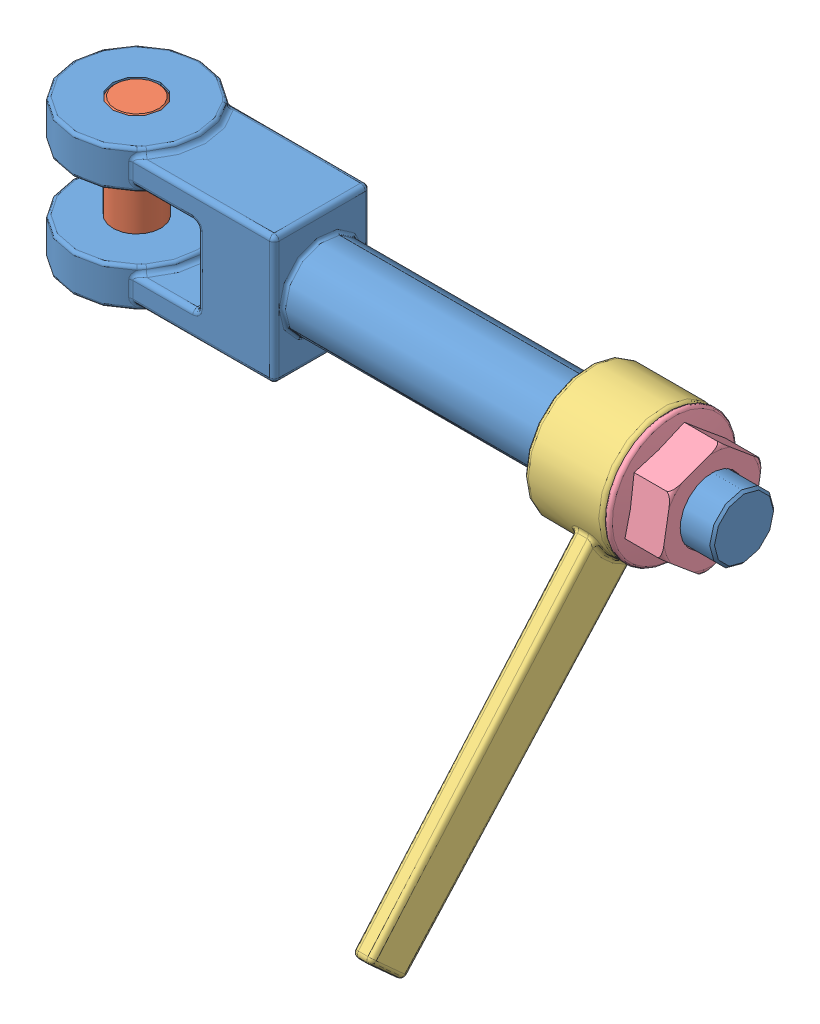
SolidWorks assembly Porte.SLDASM, configuration Défaut (file format 11000). Lengths in mm.
Overall size (420 268.69 253.92).
4 component instances, 4 part files, 7 mates.
Components (placement in the parent):
- ArbreFourche-1: ArbreFourche.SLDPRT [Défaut] at (-93.1167 22.439 0) size (420 88 80)
- Goupille-1: Goupille.SLDPRT [Défaut] at (-209.1167 66.439 0) x (-0.047297 0 -0.998881) z (0 -1 0) size (30 30 88)
- Barre-1: Barre.SLDPRT [Défaut] at (97.8833 22.439 0) x (0 0.741413 -0.671049) z (-1 0 0) size (290 80 50)
- Ecrou-1: Ecrou.SLDPRT [M8-1.25] at (122.8833 22.439 0) x (0 -0.171163 -0.985243) z (1 0 0) size (80 80 28)
Mates (geometry in assembly coordinates):
- Concentrique1: concentric: cylinder of ArbreFourche-1 through (-209.1167 66.439 0) axis (0 -1 0) radius 15; cylinder of Goupille-1 through (-209.1167 -21.561 0) axis (0 1 0) radius 15
- Coïncidente1: coincident: plane of ArbreFourche-1 through (-209.1167 -21.561 0) normal (0 -1 0); plane of Goupille-1 through (-209.1167 -21.561 0) normal (0 -1 0)
- Coïncidente2: coincident: plane of ArbreFourche-1 through (72.8833 22.439 0) normal (1 0 0); plane of Barre-1 through (72.8833 22.439 0) normal (-1 0 0)
- Concentrique2: concentric: cylinder of ArbreFourche-1 through (170.8833 22.439 0) axis (-1 0 0) radius 20; cylinder of Barre-1 through (122.8833 22.439 0) axis (-1 0 0) radius 20
- Angle1: planar angle = 3.857178 rad: plane of ArbreFourche-1 through (-144.1167 43.439 30) normal (0 0 1); plane of Barre-1 through (113.8833 7.1478 36.9619) normal (0 0.656059 0.75471)
- Coïncidente3: coincident: plane of Barre-1 through (122.8833 22.439 0) normal (1 0 0); plane of Ecrou-1 through (122.8833 32.3665 57.1441) normal (-1 0 0)
- Concentrique3: concentric: cylinder of ArbreFourche-1 through (170.8833 22.439 0) axis (-1 0 0) radius 20; cylinder of Ecrou-1 through (150.8833 22.439 0) axis (-1 0 0) radius 20
